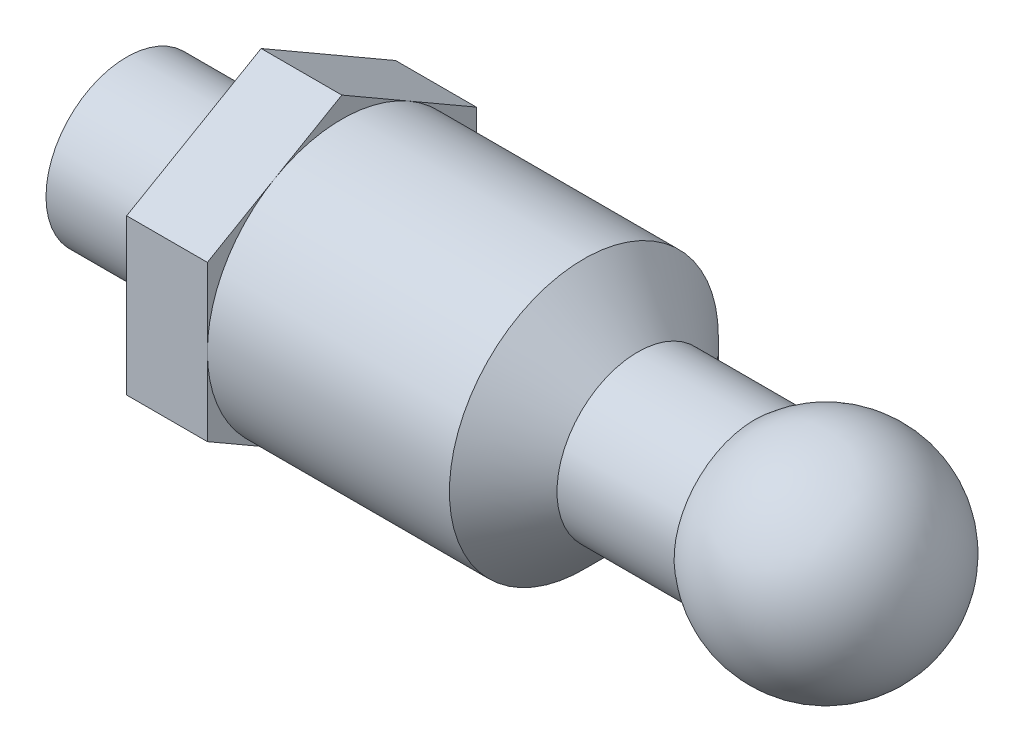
ISO-10303-21;
HEADER;
FILE_DESCRIPTION(('STEP AP214'),'2;1');
FILE_NAME('part.step','',(''),(''),'','','');
FILE_SCHEMA(('AUTOMOTIVE_DESIGN { 1 0 10303 214 1 1 1 1 }'));
ENDSEC;
DATA;
#1=APPLICATION_CONTEXT('core data for automotive mechanical design processes');
#2=APPLICATION_PROTOCOL_DEFINITION('international standard','automotive_design',2000,#1);
#3=PRODUCT_CONTEXT('',#1,'mechanical');
#4=PRODUCT('Part','Part','',(#3));
#5=PRODUCT_RELATED_PRODUCT_CATEGORY('part','',(#4));
#6=PRODUCT_DEFINITION_FORMATION('','',#4);
#7=PRODUCT_DEFINITION_CONTEXT('part definition',#1,'design');
#8=PRODUCT_DEFINITION('design','',#6,#7);
#9=PRODUCT_DEFINITION_SHAPE('','',#8);
#10=(LENGTH_UNIT() NAMED_UNIT(*) SI_UNIT(.MILLI.,.METRE.));
#11=(NAMED_UNIT(*) PLANE_ANGLE_UNIT() SI_UNIT($,.RADIAN.));
#12=(NAMED_UNIT(*) SI_UNIT($,.STERADIAN.) SOLID_ANGLE_UNIT());
#13=UNCERTAINTY_MEASURE_WITH_UNIT(LENGTH_MEASURE(1.E-05),#10,'distance_accuracy_value','');
#14=(GEOMETRIC_REPRESENTATION_CONTEXT(3) GLOBAL_UNCERTAINTY_ASSIGNED_CONTEXT((#13)) GLOBAL_UNIT_ASSIGNED_CONTEXT((#10,
#11,#12)) REPRESENTATION_CONTEXT('',''));
#15=CARTESIAN_POINT('',(0.,0.,0.));
#16=DIRECTION('',(0.,0.,1.));
#17=DIRECTION('',(1.,0.,0.));
#18=AXIS2_PLACEMENT_3D('',#15,#16,#17);
#19=CARTESIAN_POINT('',(0.,0.,0.));
#20=DIRECTION('',(1.,0.,0.));
#21=DIRECTION('',(0.,0.,-1.));
#22=AXIS2_PLACEMENT_3D('',#19,#20,#21);
#23=CYLINDRICAL_SURFACE('',#22,2.5);
#24=CARTESIAN_POINT('',(-4.50000000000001,0.,0.));
#25=DIRECTION('',(1.,0.,0.));
#26=DIRECTION('',(0.,0.,-1.));
#27=AXIS2_PLACEMENT_3D('',#24,#25,#26);
#28=CIRCLE('',#27,2.5);
#29=CARTESIAN_POINT('',(-4.50000000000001,0.,-2.5));
#30=VERTEX_POINT('',#29);
#31=EDGE_CURVE('E472',#30,#30,#28,.F.);
#32=ORIENTED_EDGE('',*,*,#31,.T.);
#33=EDGE_LOOP('',(#32));
#34=FACE_BOUND('',#33,.T.);
#35=CARTESIAN_POINT('',(-9.,0.,0.));
#36=DIRECTION('',(-1.,0.,0.));
#37=DIRECTION('',(0.,0.,1.));
#38=AXIS2_PLACEMENT_3D('',#35,#36,#37);
#39=CIRCLE('',#38,2.5);
#40=CARTESIAN_POINT('',(-9.,2.16506350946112,1.25000000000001));
#41=VERTEX_POINT('',#40);
#42=CARTESIAN_POINT('',(-9.,0.,2.50000000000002));
#43=VERTEX_POINT('',#42);
#44=EDGE_CURVE('E356',#41,#43,#39,.F.);
#45=ORIENTED_EDGE('',*,*,#44,.T.);
#46=CARTESIAN_POINT('',(-9.,-2.16506350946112,1.25000000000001));
#47=VERTEX_POINT('',#46);
#48=EDGE_CURVE('E11',#43,#47,#39,.F.);
#49=ORIENTED_EDGE('',*,*,#48,.T.);
#50=CARTESIAN_POINT('',(-9.,-2.16506350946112,-1.24999999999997));
#51=VERTEX_POINT('',#50);
#52=EDGE_CURVE('E361',#47,#51,#39,.F.);
#53=ORIENTED_EDGE('',*,*,#52,.T.);
#54=CARTESIAN_POINT('',(-9.,0.,-2.50000000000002));
#55=VERTEX_POINT('',#54);
#56=EDGE_CURVE('E482',#51,#55,#39,.F.);
#57=ORIENTED_EDGE('',*,*,#56,.T.);
#58=CARTESIAN_POINT('',(-9.,2.16506350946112,-1.25000000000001));
#59=VERTEX_POINT('',#58);
#60=EDGE_CURVE('E480',#55,#59,#39,.F.);
#61=ORIENTED_EDGE('',*,*,#60,.T.);
#62=EDGE_CURVE('E477',#59,#41,#39,.F.);
#63=ORIENTED_EDGE('',*,*,#62,.T.);
#64=EDGE_LOOP('',(#45,#49,#53,#57,#61,#63));
#65=FACE_BOUND('',#64,.T.);
#66=ADVANCED_FACE('F352',(#34,#65),#23,.T.);
#67=CARTESIAN_POINT('',(0.,0.,0.));
#68=DIRECTION('',(1.,0.,0.));
#69=DIRECTION('',(0.,1.,0.));
#70=AXIS2_PLACEMENT_3D('',#67,#68,#69);
#71=SPHERICAL_SURFACE('',#70,2.);
#72=CARTESIAN_POINT('',(-1.3228756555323,0.,0.));
#73=DIRECTION('',(1.,0.,0.));
#74=DIRECTION('',(0.,0.,-1.));
#75=AXIS2_PLACEMENT_3D('',#72,#73,#74);
#76=CIRCLE('',#75,1.5);
#77=CARTESIAN_POINT('',(-1.3228756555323,0.,-1.5));
#78=VERTEX_POINT('',#77);
#79=EDGE_CURVE('E470',#78,#78,#76,.T.);
#80=ORIENTED_EDGE('',*,*,#79,.T.);
#81=EDGE_LOOP('',(#80));
#82=FACE_BOUND('',#81,.T.);
#83=ADVANCED_FACE('F546',(#82),#71,.T.);
#84=CARTESIAN_POINT('',(0.,0.,0.));
#85=DIRECTION('',(1.,0.,0.));
#86=DIRECTION('',(0.,0.,-1.));
#87=AXIS2_PLACEMENT_3D('',#84,#85,#86);
#88=CYLINDRICAL_SURFACE('',#87,1.5);
#89=CARTESIAN_POINT('',(-3.5,0.,0.));
#90=DIRECTION('',(1.,0.,0.));
#91=DIRECTION('',(0.,0.,-1.));
#92=AXIS2_PLACEMENT_3D('',#89,#90,#91);
#93=CIRCLE('',#92,1.5);
#94=CARTESIAN_POINT('',(-3.5,0.,-1.5));
#95=VERTEX_POINT('',#94);
#96=EDGE_CURVE('E467',#95,#95,#93,.T.);
#97=ORIENTED_EDGE('',*,*,#96,.T.);
#98=EDGE_LOOP('',(#97));
#99=FACE_BOUND('',#98,.T.);
#100=ORIENTED_EDGE('',*,*,#79,.F.);
#101=EDGE_LOOP('',(#100));
#102=FACE_BOUND('',#101,.T.);
#103=ADVANCED_FACE('F551',(#99,#102),#88,.T.);
#104=CARTESIAN_POINT('',(-3.5,0.,0.));
#105=DIRECTION('',(-1.,0.,0.));
#106=DIRECTION('',(0.,0.,1.));
#107=AXIS2_PLACEMENT_3D('',#104,#105,#106);
#108=CONICAL_SURFACE('',#107,1.5,0.785398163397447);
#109=ORIENTED_EDGE('',*,*,#31,.F.);
#110=EDGE_LOOP('',(#109));
#111=FACE_BOUND('',#110,.T.);
#112=ORIENTED_EDGE('',*,*,#96,.F.);
#113=EDGE_LOOP('',(#112));
#114=FACE_BOUND('',#113,.T.);
#115=ADVANCED_FACE('F555',(#111,#114),#108,.T.);
#116=CARTESIAN_POINT('',(-9.,-1.44337567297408,-2.50000000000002));
#117=DIRECTION('',(0.,-0.866025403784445,-0.499999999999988));
#118=DIRECTION('',(0.,0.499999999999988,-0.866025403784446));
#119=AXIS2_PLACEMENT_3D('',#116,#117,#118);
#120=PLANE('',#119);
#121=DIRECTION('',(0.,-0.499999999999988,0.866025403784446));
#122=VECTOR('',#121,1.);
#123=CARTESIAN_POINT('',(-10.5,-1.44337567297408,-2.50000000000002));
#124=LINE('',#123,#122);
#125=CARTESIAN_POINT('',(-10.5,-1.44337567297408,-2.50000000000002));
#126=VERTEX_POINT('',#125);
#127=CARTESIAN_POINT('',(-10.5,-2.88675134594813,0.));
#128=VERTEX_POINT('',#127);
#129=EDGE_CURVE('E437',#126,#128,#124,.T.);
#130=ORIENTED_EDGE('',*,*,#129,.F.);
#131=DIRECTION('',(-1.,0.,0.));
#132=VECTOR('',#131,1.);
#133=CARTESIAN_POINT('',(-9.,-1.44337567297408,-2.50000000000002));
#134=LINE('',#133,#132);
#135=CARTESIAN_POINT('',(-9.,-1.44337567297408,-2.50000000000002));
#136=VERTEX_POINT('',#135);
#137=EDGE_CURVE('E464',#136,#126,#134,.T.);
#138=ORIENTED_EDGE('',*,*,#137,.F.);
#139=DIRECTION('',(0.,-0.499999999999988,0.866025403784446));
#140=VECTOR('',#139,1.);
#141=CARTESIAN_POINT('',(-9.,-1.44337567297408,-2.50000000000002));
#142=LINE('',#141,#140);
#143=EDGE_CURVE('E489',#136,#51,#142,.T.);
#144=ORIENTED_EDGE('',*,*,#143,.T.);
#145=CARTESIAN_POINT('',(-9.,-2.88675134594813,0.));
#146=VERTEX_POINT('',#145);
#147=EDGE_CURVE('E450',#51,#146,#142,.T.);
#148=ORIENTED_EDGE('',*,*,#147,.T.);
#149=DIRECTION('',(-1.,0.,0.));
#150=VECTOR('',#149,1.);
#151=CARTESIAN_POINT('',(-9.,-2.88675134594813,0.));
#152=LINE('',#151,#150);
#153=EDGE_CURVE('E431',#146,#128,#152,.T.);
#154=ORIENTED_EDGE('',*,*,#153,.T.);
#155=EDGE_LOOP('',(#130,#138,#144,#148,#154));
#156=FACE_BOUND('',#155,.T.);
#157=ADVANCED_FACE('F448',(#156),#120,.T.);
#158=CARTESIAN_POINT('',(-9.,1.44337567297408,-2.50000000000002));
#159=DIRECTION('',(0.,0.,-1.));
#160=DIRECTION('',(-1.,0.,0.));
#161=AXIS2_PLACEMENT_3D('',#158,#159,#160);
#162=PLANE('',#161);
#163=DIRECTION('',(0.,-1.,0.));
#164=VECTOR('',#163,1.);
#165=CARTESIAN_POINT('',(-10.5,1.44337567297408,-2.50000000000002));
#166=LINE('',#165,#164);
#167=CARTESIAN_POINT('',(-10.5,1.44337567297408,-2.50000000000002));
#168=VERTEX_POINT('',#167);
#169=EDGE_CURVE('E443',#168,#126,#166,.T.);
#170=ORIENTED_EDGE('',*,*,#169,.F.);
#171=DIRECTION('',(-1.,0.,0.));
#172=VECTOR('',#171,1.);
#173=CARTESIAN_POINT('',(-9.,1.44337567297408,-2.50000000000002));
#174=LINE('',#173,#172);
#175=CARTESIAN_POINT('',(-9.,1.44337567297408,-2.50000000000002));
#176=VERTEX_POINT('',#175);
#177=EDGE_CURVE('E505',#176,#168,#174,.T.);
#178=ORIENTED_EDGE('',*,*,#177,.F.);
#179=DIRECTION('',(0.,-1.,0.));
#180=VECTOR('',#179,1.);
#181=CARTESIAN_POINT('',(-9.,1.44337567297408,-2.50000000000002));
#182=LINE('',#181,#180);
#183=EDGE_CURVE('E451',#176,#55,#182,.T.);
#184=ORIENTED_EDGE('',*,*,#183,.T.);
#185=EDGE_CURVE('E456',#55,#136,#182,.T.);
#186=ORIENTED_EDGE('',*,*,#185,.T.);
#187=ORIENTED_EDGE('',*,*,#137,.T.);
#188=EDGE_LOOP('',(#170,#178,#184,#186,#187));
#189=FACE_BOUND('',#188,.T.);
#190=ADVANCED_FACE('F570',(#189),#162,.T.);
#191=CARTESIAN_POINT('',(-9.,2.88675134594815,0.));
#192=DIRECTION('',(0.,0.866025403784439,-0.5));
#193=DIRECTION('',(0.,0.5,0.866025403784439));
#194=AXIS2_PLACEMENT_3D('',#191,#192,#193);
#195=PLANE('',#194);
#196=DIRECTION('',(0.,-0.5,-0.866025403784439));
#197=VECTOR('',#196,1.);
#198=CARTESIAN_POINT('',(-10.5,2.88675134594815,0.));
#199=LINE('',#198,#197);
#200=CARTESIAN_POINT('',(-10.5,2.88675134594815,0.));
#201=VERTEX_POINT('',#200);
#202=EDGE_CURVE('E527',#201,#168,#199,.T.);
#203=ORIENTED_EDGE('',*,*,#202,.F.);
#204=DIRECTION('',(-1.,0.,0.));
#205=VECTOR('',#204,1.);
#206=CARTESIAN_POINT('',(-9.,2.88675134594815,0.));
#207=LINE('',#206,#205);
#208=CARTESIAN_POINT('',(-9.,2.88675134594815,0.));
#209=VERTEX_POINT('',#208);
#210=EDGE_CURVE('E508',#209,#201,#207,.T.);
#211=ORIENTED_EDGE('',*,*,#210,.F.);
#212=DIRECTION('',(0.,-0.5,-0.866025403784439));
#213=VECTOR('',#212,1.);
#214=CARTESIAN_POINT('',(-9.,2.88675134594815,0.));
#215=LINE('',#214,#213);
#216=EDGE_CURVE('E501',#209,#59,#215,.T.);
#217=ORIENTED_EDGE('',*,*,#216,.T.);
#218=EDGE_CURVE('E500',#59,#176,#215,.T.);
#219=ORIENTED_EDGE('',*,*,#218,.T.);
#220=ORIENTED_EDGE('',*,*,#177,.T.);
#221=EDGE_LOOP('',(#203,#211,#217,#219,#220));
#222=FACE_BOUND('',#221,.T.);
#223=ADVANCED_FACE('F526',(#222),#195,.T.);
#224=CARTESIAN_POINT('',(-9.,1.44337567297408,2.50000000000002));
#225=DIRECTION('',(0.,0.866025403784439,0.5));
#226=DIRECTION('',(0.,-0.5,0.866025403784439));
#227=AXIS2_PLACEMENT_3D('',#224,#225,#226);
#228=PLANE('',#227);
#229=DIRECTION('',(0.,0.5,-0.866025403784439));
#230=VECTOR('',#229,1.);
#231=CARTESIAN_POINT('',(-10.5,1.44337567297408,2.50000000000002));
#232=LINE('',#231,#230);
#233=CARTESIAN_POINT('',(-10.5,1.44337567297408,2.50000000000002));
#234=VERTEX_POINT('',#233);
#235=EDGE_CURVE('E516',#234,#201,#232,.T.);
#236=ORIENTED_EDGE('',*,*,#235,.F.);
#237=DIRECTION('',(-1.,0.,0.));
#238=VECTOR('',#237,1.);
#239=CARTESIAN_POINT('',(-9.,1.44337567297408,2.50000000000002));
#240=LINE('',#239,#238);
#241=CARTESIAN_POINT('',(-9.,1.44337567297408,2.50000000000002));
#242=VERTEX_POINT('',#241);
#243=EDGE_CURVE('E453',#242,#234,#240,.T.);
#244=ORIENTED_EDGE('',*,*,#243,.F.);
#245=DIRECTION('',(0.,0.5,-0.866025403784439));
#246=VECTOR('',#245,1.);
#247=CARTESIAN_POINT('',(-9.,1.44337567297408,2.50000000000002));
#248=LINE('',#247,#246);
#249=EDGE_CURVE('E497',#242,#41,#248,.T.);
#250=ORIENTED_EDGE('',*,*,#249,.T.);
#251=EDGE_CURVE('E496',#41,#209,#248,.T.);
#252=ORIENTED_EDGE('',*,*,#251,.T.);
#253=ORIENTED_EDGE('',*,*,#210,.T.);
#254=EDGE_LOOP('',(#236,#244,#250,#252,#253));
#255=FACE_BOUND('',#254,.T.);
#256=ADVANCED_FACE('F515',(#255),#228,.T.);
#257=CARTESIAN_POINT('',(-9.,-1.44337567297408,2.50000000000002));
#258=DIRECTION('',(0.,0.,1.));
#259=DIRECTION('',(1.,0.,0.));
#260=AXIS2_PLACEMENT_3D('',#257,#258,#259);
#261=PLANE('',#260);
#262=ORIENTED_EDGE('',*,*,#243,.T.);
#263=DIRECTION('',(0.,1.,0.));
#264=VECTOR('',#263,1.);
#265=CARTESIAN_POINT('',(-10.5,-1.44337567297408,2.50000000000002));
#266=LINE('',#265,#264);
#267=CARTESIAN_POINT('',(-10.5,-1.44337567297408,2.50000000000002));
#268=VERTEX_POINT('',#267);
#269=EDGE_CURVE('E436',#268,#234,#266,.T.);
#270=ORIENTED_EDGE('',*,*,#269,.F.);
#271=DIRECTION('',(-1.,0.,0.));
#272=VECTOR('',#271,1.);
#273=CARTESIAN_POINT('',(-9.,-1.44337567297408,2.50000000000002));
#274=LINE('',#273,#272);
#275=CARTESIAN_POINT('',(-9.,-1.44337567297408,2.50000000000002));
#276=VERTEX_POINT('',#275);
#277=EDGE_CURVE('E432',#276,#268,#274,.T.);
#278=ORIENTED_EDGE('',*,*,#277,.F.);
#279=DIRECTION('',(0.,1.,0.));
#280=VECTOR('',#279,1.);
#281=CARTESIAN_POINT('',(-9.,-1.44337567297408,2.50000000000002));
#282=LINE('',#281,#280);
#283=EDGE_CURVE('E368',#276,#43,#282,.T.);
#284=ORIENTED_EDGE('',*,*,#283,.T.);
#285=EDGE_CURVE('E491',#43,#242,#282,.T.);
#286=ORIENTED_EDGE('',*,*,#285,.T.);
#287=EDGE_LOOP('',(#262,#270,#278,#284,#286));
#288=FACE_BOUND('',#287,.T.);
#289=ADVANCED_FACE('F512',(#288),#261,.T.);
#290=CARTESIAN_POINT('',(-9.,-2.88675134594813,0.));
#291=DIRECTION('',(0.,-0.866025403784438,0.5));
#292=DIRECTION('',(0.,-0.5,-0.866025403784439));
#293=AXIS2_PLACEMENT_3D('',#290,#291,#292);
#294=PLANE('',#293);
#295=DIRECTION('',(0.,0.5,0.866025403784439));
#296=VECTOR('',#295,1.);
#297=CARTESIAN_POINT('',(-10.5,-2.88675134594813,0.));
#298=LINE('',#297,#296);
#299=EDGE_CURVE('E426',#128,#268,#298,.T.);
#300=ORIENTED_EDGE('',*,*,#299,.F.);
#301=ORIENTED_EDGE('',*,*,#153,.F.);
#302=DIRECTION('',(0.,0.5,0.866025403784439));
#303=VECTOR('',#302,1.);
#304=CARTESIAN_POINT('',(-9.,-2.88675134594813,0.));
#305=LINE('',#304,#303);
#306=EDGE_CURVE('E488',#146,#47,#305,.T.);
#307=ORIENTED_EDGE('',*,*,#306,.T.);
#308=EDGE_CURVE('E487',#47,#276,#305,.T.);
#309=ORIENTED_EDGE('',*,*,#308,.T.);
#310=ORIENTED_EDGE('',*,*,#277,.T.);
#311=EDGE_LOOP('',(#300,#301,#307,#309,#310));
#312=FACE_BOUND('',#311,.T.);
#313=ADVANCED_FACE('F428',(#312),#294,.T.);
#314=CARTESIAN_POINT('',(-9.,-4.33012701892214,2.50000000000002));
#315=DIRECTION('',(-1.,0.,0.));
#316=DIRECTION('',(0.,0.,1.));
#317=AXIS2_PLACEMENT_3D('',#314,#315,#316);
#318=PLANE('',#317);
#319=ORIENTED_EDGE('',*,*,#48,.F.);
#320=ORIENTED_EDGE('',*,*,#283,.F.);
#321=ORIENTED_EDGE('',*,*,#308,.F.);
#322=EDGE_LOOP('',(#319,#320,#321));
#323=FACE_BOUND('',#322,.T.);
#324=ADVANCED_FACE('F486',(#323),#318,.F.);
#325=ORIENTED_EDGE('',*,*,#52,.F.);
#326=ORIENTED_EDGE('',*,*,#306,.F.);
#327=ORIENTED_EDGE('',*,*,#147,.F.);
#328=EDGE_LOOP('',(#325,#326,#327));
#329=FACE_BOUND('',#328,.T.);
#330=ADVANCED_FACE('F536',(#329),#318,.F.);
#331=ORIENTED_EDGE('',*,*,#56,.F.);
#332=ORIENTED_EDGE('',*,*,#143,.F.);
#333=ORIENTED_EDGE('',*,*,#185,.F.);
#334=EDGE_LOOP('',(#331,#332,#333));
#335=FACE_BOUND('',#334,.T.);
#336=ADVANCED_FACE('F535',(#335),#318,.F.);
#337=ORIENTED_EDGE('',*,*,#60,.F.);
#338=ORIENTED_EDGE('',*,*,#183,.F.);
#339=ORIENTED_EDGE('',*,*,#218,.F.);
#340=EDGE_LOOP('',(#337,#338,#339));
#341=FACE_BOUND('',#340,.T.);
#342=ADVANCED_FACE('F543',(#341),#318,.F.);
#343=ORIENTED_EDGE('',*,*,#62,.F.);
#344=ORIENTED_EDGE('',*,*,#216,.F.);
#345=ORIENTED_EDGE('',*,*,#251,.F.);
#346=EDGE_LOOP('',(#343,#344,#345));
#347=FACE_BOUND('',#346,.T.);
#348=ADVANCED_FACE('F522',(#347),#318,.F.);
#349=ORIENTED_EDGE('',*,*,#44,.F.);
#350=ORIENTED_EDGE('',*,*,#249,.F.);
#351=ORIENTED_EDGE('',*,*,#285,.F.);
#352=EDGE_LOOP('',(#349,#350,#351));
#353=FACE_BOUND('',#352,.T.);
#354=ADVANCED_FACE('F518',(#353),#318,.F.);
#355=CARTESIAN_POINT('',(-13.,0.,0.));
#356=DIRECTION('',(-1.,0.,0.));
#357=DIRECTION('',(0.,0.,1.));
#358=AXIS2_PLACEMENT_3D('',#355,#356,#357);
#359=PLANE('',#358);
#360=CARTESIAN_POINT('',(-13.,0.,0.));
#361=DIRECTION('',(-1.,0.,0.));
#362=DIRECTION('',(0.,0.,1.));
#363=AXIS2_PLACEMENT_3D('',#360,#361,#362);
#364=CIRCLE('',#363,1.5);
#365=CARTESIAN_POINT('',(-13.,0.,1.5));
#366=VERTEX_POINT('',#365);
#367=EDGE_CURVE('E463',#366,#366,#364,.T.);
#368=ORIENTED_EDGE('',*,*,#367,.T.);
#369=EDGE_LOOP('',(#368));
#370=FACE_BOUND('',#369,.T.);
#371=ADVANCED_FACE('F579',(#370),#359,.T.);
#372=CARTESIAN_POINT('',(-13.,0.,0.));
#373=DIRECTION('',(1.,0.,0.));
#374=DIRECTION('',(0.,0.,-1.));
#375=AXIS2_PLACEMENT_3D('',#372,#373,#374);
#376=CYLINDRICAL_SURFACE('',#375,1.5);
#377=ORIENTED_EDGE('',*,*,#367,.F.);
#378=EDGE_LOOP('',(#377));
#379=FACE_BOUND('',#378,.T.);
#380=CARTESIAN_POINT('',(-10.5,0.,0.));
#381=DIRECTION('',(-1.,0.,0.));
#382=DIRECTION('',(0.,0.,1.));
#383=AXIS2_PLACEMENT_3D('',#380,#381,#382);
#384=CIRCLE('',#383,1.5);
#385=CARTESIAN_POINT('',(-10.5,0.,1.5));
#386=VERTEX_POINT('',#385);
#387=EDGE_CURVE('E460',#386,#386,#384,.T.);
#388=ORIENTED_EDGE('',*,*,#387,.T.);
#389=EDGE_LOOP('',(#388));
#390=FACE_BOUND('',#389,.T.);
#391=ADVANCED_FACE('F581',(#379,#390),#376,.T.);
#392=CARTESIAN_POINT('',(-10.5,0.,0.));
#393=DIRECTION('',(-1.,0.,0.));
#394=DIRECTION('',(0.,0.,1.));
#395=AXIS2_PLACEMENT_3D('',#392,#393,#394);
#396=PLANE('',#395);
#397=ORIENTED_EDGE('',*,*,#235,.T.);
#398=ORIENTED_EDGE('',*,*,#202,.T.);
#399=ORIENTED_EDGE('',*,*,#169,.T.);
#400=ORIENTED_EDGE('',*,*,#129,.T.);
#401=ORIENTED_EDGE('',*,*,#299,.T.);
#402=ORIENTED_EDGE('',*,*,#269,.T.);
#403=EDGE_LOOP('',(#397,#398,#399,#400,#401,#402));
#404=FACE_BOUND('',#403,.T.);
#405=ORIENTED_EDGE('',*,*,#387,.F.);
#406=EDGE_LOOP('',(#405));
#407=FACE_BOUND('',#406,.T.);
#408=ADVANCED_FACE('F354',(#404,#407),#396,.T.);
#409=CLOSED_SHELL('',(#66,#83,#103,#115,#157,#190,#223,#256,#289,#313,#324,#330,#336,#342,#348,
#354,#371,#391,#408));
#410=MANIFOLD_SOLID_BREP('B2',#409);
#411=ADVANCED_BREP_SHAPE_REPRESENTATION('',(#18,#410),#14);
#412=SHAPE_DEFINITION_REPRESENTATION(#9,#411);
ENDSEC;
END-ISO-10303-21;
